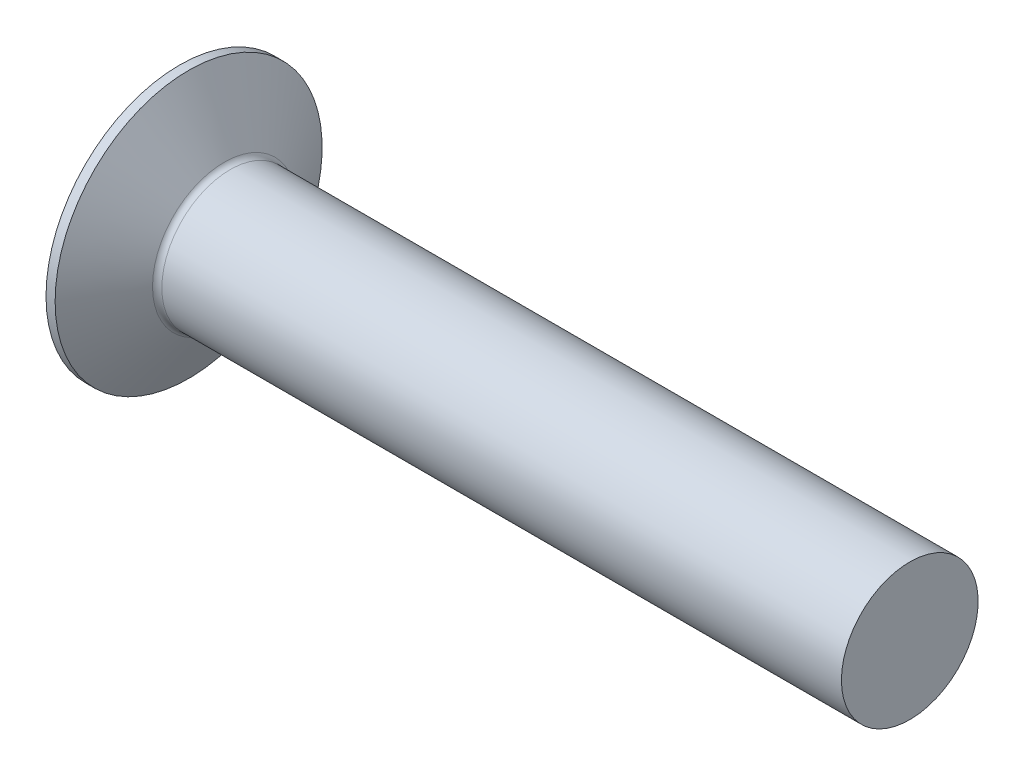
ISO-10303-21;
HEADER;
FILE_DESCRIPTION(('STEP AP214'),'2;1');
FILE_NAME('part.step','',(''),(''),'','','');
FILE_SCHEMA(('AUTOMOTIVE_DESIGN { 1 0 10303 214 1 1 1 1 }'));
ENDSEC;
DATA;
#1=APPLICATION_CONTEXT('core data for automotive mechanical design processes');
#2=APPLICATION_PROTOCOL_DEFINITION('international standard','automotive_design',2000,#1);
#3=PRODUCT_CONTEXT('',#1,'mechanical');
#4=PRODUCT('Part','Part','',(#3));
#5=PRODUCT_RELATED_PRODUCT_CATEGORY('part','',(#4));
#6=PRODUCT_DEFINITION_FORMATION('','',#4);
#7=PRODUCT_DEFINITION_CONTEXT('part definition',#1,'design');
#8=PRODUCT_DEFINITION('design','',#6,#7);
#9=PRODUCT_DEFINITION_SHAPE('','',#8);
#10=(LENGTH_UNIT() NAMED_UNIT(*) SI_UNIT(.MILLI.,.METRE.));
#11=(NAMED_UNIT(*) PLANE_ANGLE_UNIT() SI_UNIT($,.RADIAN.));
#12=(NAMED_UNIT(*) SI_UNIT($,.STERADIAN.) SOLID_ANGLE_UNIT());
#13=UNCERTAINTY_MEASURE_WITH_UNIT(LENGTH_MEASURE(1.E-05),#10,'distance_accuracy_value','');
#14=(GEOMETRIC_REPRESENTATION_CONTEXT(3) GLOBAL_UNCERTAINTY_ASSIGNED_CONTEXT((#13)) GLOBAL_UNIT_ASSIGNED_CONTEXT((#10,
#11,#12)) REPRESENTATION_CONTEXT('',''));
#15=CARTESIAN_POINT('',(0.,0.,0.));
#16=DIRECTION('',(0.,0.,1.));
#17=DIRECTION('',(1.,0.,0.));
#18=AXIS2_PLACEMENT_3D('',#15,#16,#17);
#19=CARTESIAN_POINT('',(32.9774728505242,0.,0.));
#20=DIRECTION('',(-1.,0.,0.));
#21=DIRECTION('',(0.,0.,1.));
#22=AXIS2_PLACEMENT_3D('',#19,#20,#21);
#23=PLANE('',#22);
#24=CARTESIAN_POINT('',(32.9774728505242,0.,0.));
#25=DIRECTION('',(-1.,0.,0.));
#26=DIRECTION('',(0.,0.,1.));
#27=AXIS2_PLACEMENT_3D('',#24,#25,#26);
#28=CIRCLE('',#27,3.);
#29=CARTESIAN_POINT('',(32.9774728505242,0.,3.));
#30=VERTEX_POINT('',#29);
#31=EDGE_CURVE('E10',#30,#30,#28,.T.);
#32=ORIENTED_EDGE('',*,*,#31,.F.);
#33=EDGE_LOOP('',(#32));
#34=FACE_BOUND('',#33,.T.);
#35=ADVANCED_FACE('F30',(#34),#23,.F.);
#36=CARTESIAN_POINT('',(-58.1432960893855,0.,0.));
#37=DIRECTION('',(-1.,0.,0.));
#38=DIRECTION('',(0.,0.,1.));
#39=AXIS2_PLACEMENT_3D('',#36,#37,#38);
#40=CYLINDRICAL_SURFACE('',#39,3.);
#41=CARTESIAN_POINT('',(3.15067793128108,0.,0.));
#42=DIRECTION('',(-1.,0.,0.));
#43=DIRECTION('',(0.,0.,1.));
#44=AXIS2_PLACEMENT_3D('',#41,#42,#43);
#45=CIRCLE('',#44,3.);
#46=CARTESIAN_POINT('',(3.15067793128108,0.,3.));
#47=VERTEX_POINT('',#46);
#48=EDGE_CURVE('E36',#47,#47,#45,.T.);
#49=ORIENTED_EDGE('',*,*,#48,.F.);
#50=EDGE_LOOP('',(#49));
#51=FACE_BOUND('',#50,.T.);
#52=ORIENTED_EDGE('',*,*,#31,.T.);
#53=EDGE_LOOP('',(#52));
#54=FACE_BOUND('',#53,.T.);
#55=ADVANCED_FACE('F69',(#51,#54),#40,.T.);
#56=CARTESIAN_POINT('',(3.15067793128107,0.,0.));
#57=DIRECTION('',(-1.,0.,0.));
#58=DIRECTION('',(0.,0.,1.));
#59=AXIS2_PLACEMENT_3D('',#56,#57,#58);
#60=TOROIDAL_SURFACE('',#59,3.3,0.299999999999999);
#61=CARTESIAN_POINT('',(2.89087031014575,0.,0.));
#62=DIRECTION('',(-1.,0.,0.));
#63=DIRECTION('',(0.,0.,1.));
#64=AXIS2_PLACEMENT_3D('',#61,#62,#63);
#65=CIRCLE('',#64,3.14999999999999);
#66=CARTESIAN_POINT('',(2.89087031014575,0.,3.14999999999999));
#67=VERTEX_POINT('',#66);
#68=EDGE_CURVE('E40',#67,#67,#65,.T.);
#69=ORIENTED_EDGE('',*,*,#68,.F.);
#70=EDGE_LOOP('',(#69));
#71=FACE_BOUND('',#70,.T.);
#72=ORIENTED_EDGE('',*,*,#48,.T.);
#73=EDGE_LOOP('',(#72));
#74=FACE_BOUND('',#73,.T.);
#75=ADVANCED_FACE('F64',(#71,#74),#60,.F.);
#76=CARTESIAN_POINT('',(2.89087031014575,0.,0.));
#77=DIRECTION('',(-1.,0.,0.));
#78=DIRECTION('',(0.,0.,1.));
#79=AXIS2_PLACEMENT_3D('',#76,#77,#78);
#80=CONICAL_SURFACE('',#79,3.14999999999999,1.04719755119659);
#81=CARTESIAN_POINT('',(1.32625108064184,0.,0.));
#82=DIRECTION('',(-1.,0.,0.));
#83=DIRECTION('',(0.,0.,1.));
#84=AXIS2_PLACEMENT_3D('',#81,#82,#83);
#85=CIRCLE('',#84,5.86);
#86=CARTESIAN_POINT('',(1.32625108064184,0.,5.86));
#87=VERTEX_POINT('',#86);
#88=EDGE_CURVE('E44',#87,#87,#85,.T.);
#89=ORIENTED_EDGE('',*,*,#88,.F.);
#90=EDGE_LOOP('',(#89));
#91=FACE_BOUND('',#90,.T.);
#92=ORIENTED_EDGE('',*,*,#68,.T.);
#93=EDGE_LOOP('',(#92));
#94=FACE_BOUND('',#93,.T.);
#95=ADVANCED_FACE('F58',(#91,#94),#80,.T.);
#96=CARTESIAN_POINT('',(-58.1432960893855,0.,0.));
#97=DIRECTION('',(-1.,0.,0.));
#98=DIRECTION('',(0.,0.,1.));
#99=AXIS2_PLACEMENT_3D('',#96,#97,#98);
#100=CYLINDRICAL_SURFACE('',#99,5.86);
#101=CARTESIAN_POINT('',(0.926251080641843,0.,0.));
#102=DIRECTION('',(-1.,0.,0.));
#103=DIRECTION('',(0.,0.,1.));
#104=AXIS2_PLACEMENT_3D('',#101,#102,#103);
#105=CIRCLE('',#104,5.86);
#106=CARTESIAN_POINT('',(0.926251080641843,0.,5.86));
#107=VERTEX_POINT('',#106);
#108=EDGE_CURVE('E49',#107,#107,#105,.T.);
#109=ORIENTED_EDGE('',*,*,#108,.F.);
#110=EDGE_LOOP('',(#109));
#111=FACE_BOUND('',#110,.T.);
#112=ORIENTED_EDGE('',*,*,#88,.T.);
#113=EDGE_LOOP('',(#112));
#114=FACE_BOUND('',#113,.T.);
#115=ADVANCED_FACE('F55',(#111,#114),#100,.T.);
#116=CARTESIAN_POINT('',(19.,0.,0.));
#117=DIRECTION('',(-1.,0.,0.));
#118=DIRECTION('',(0.,1.,0.));
#119=AXIS2_PLACEMENT_3D('',#116,#117,#118);
#120=SPHERICAL_SURFACE('',#119,19.);
#121=ORIENTED_EDGE('',*,*,#108,.T.);
#122=EDGE_LOOP('',(#121));
#123=FACE_BOUND('',#122,.T.);
#124=ADVANCED_FACE('F53',(#123),#120,.T.);
#125=CLOSED_SHELL('',(#35,#55,#75,#95,#115,#124));
#126=MANIFOLD_SOLID_BREP('B2',#125);
#127=ADVANCED_BREP_SHAPE_REPRESENTATION('',(#18,#126),#14);
#128=SHAPE_DEFINITION_REPRESENTATION(#9,#127);
ENDSEC;
END-ISO-10303-21;
